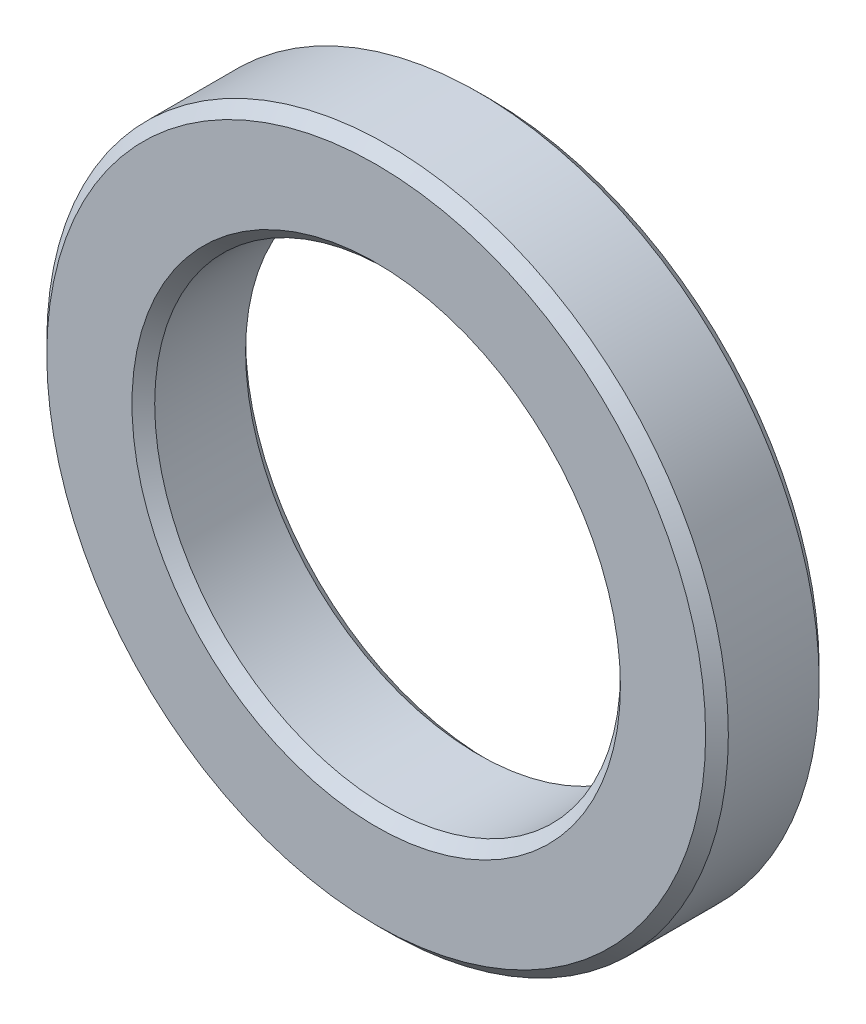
from build123d import *

# Parameters (mm, degrees)
SKETCH1_R           = 6
SKETCH1_R_2         = 4.1
BOSS_EXTRUDE2_DEPTH = 1
CHAMFER3_SIZE       = 0.2


with BuildPart() as part:
    # Sketch1 → Boss-Extrude2 (new, symmetric)
    with BuildSketch(Plane.XY):
        Circle(SKETCH1_R)
        Circle(SKETCH1_R_2, mode=Mode.SUBTRACT)
    extrude(amount=BOSS_EXTRUDE2_DEPTH, both=True)

    # Chamfer3
    chamfer3_edges = [part.edges().sort_by_distance(p)[0] for p in [
        (-6, 0, -1),
        (-6, 0, 1),
        (-4.1, 0, -1),
        (-4.1, 0, 1),
    ]]
    chamfer(chamfer3_edges, length=CHAMFER3_SIZE)


solid = part.part
